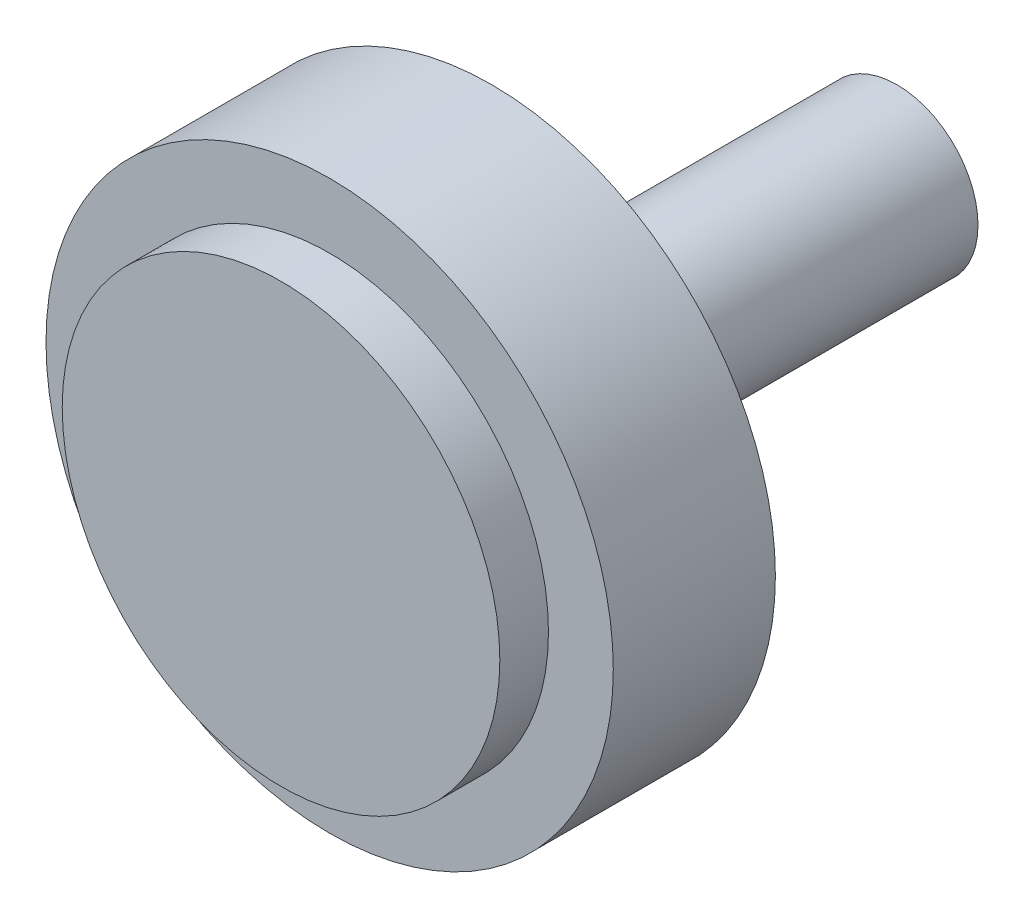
from build123d import *

# Parameters (mm, degrees)
ESQUISSE1_R      = 17.5
EXTRUSION1_DEPTH = 10
ESQUISSE2_R      = 13.5
EXTRUSION2_DEPTH = 3
ESQUISSE3_R      = 5
EXTRUSION3_DEPTH = 25


with BuildPart() as part:
    # Esquisse1 → Extrusion1 (new body)
    with BuildSketch(Plane.XY):
        Circle(ESQUISSE1_R)
    extrude(amount=EXTRUSION1_DEPTH)

    # Esquisse2 → Extrusion2 (add)
    with BuildSketch(Plane.XY.offset(10)):
        Circle(ESQUISSE2_R)
    extrude(amount=EXTRUSION2_DEPTH)

    # Esquisse3 → Extrusion3 (add)
    with BuildSketch(Plane(origin=(0, 0, 0), x_dir=(-1, 0, 0), z_dir=(0, 0, -1))):
        with Locations(Location((0, 0, 0), (0, 0, 180))):
            Circle(ESQUISSE3_R)
    extrude(amount=EXTRUSION3_DEPTH)


solid = part.part
